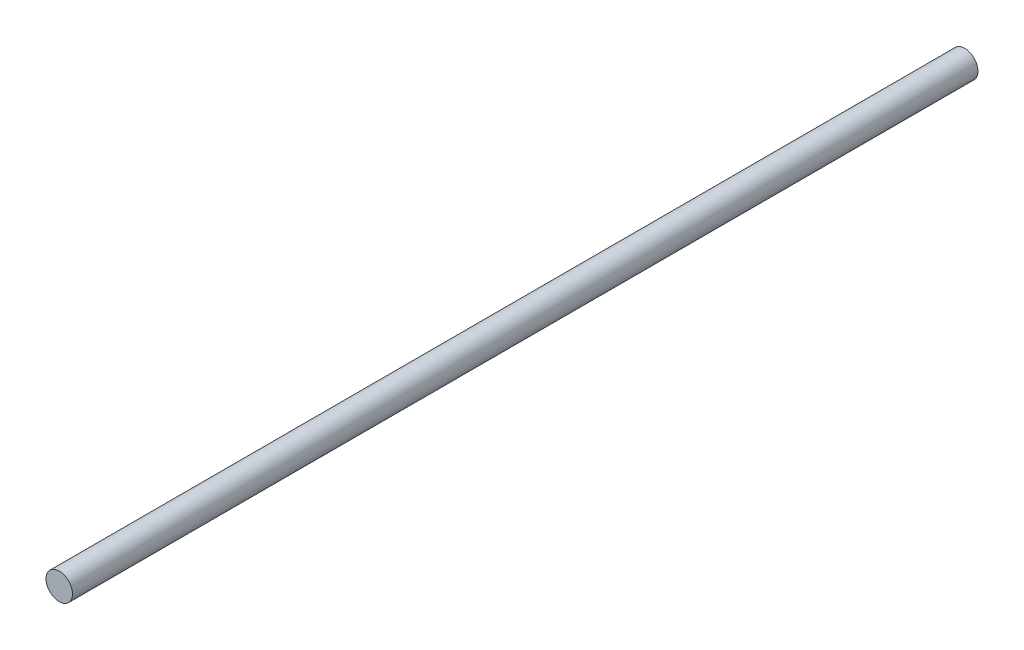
ISO-10303-21;
HEADER;
FILE_DESCRIPTION(('STEP AP214'),'2;1');
FILE_NAME('part.step','',(''),(''),'','','');
FILE_SCHEMA(('AUTOMOTIVE_DESIGN { 1 0 10303 214 1 1 1 1 }'));
ENDSEC;
DATA;
#1=APPLICATION_CONTEXT('core data for automotive mechanical design processes');
#2=APPLICATION_PROTOCOL_DEFINITION('international standard','automotive_design',2000,#1);
#3=PRODUCT_CONTEXT('',#1,'mechanical');
#4=PRODUCT('Part','Part','',(#3));
#5=PRODUCT_RELATED_PRODUCT_CATEGORY('part','',(#4));
#6=PRODUCT_DEFINITION_FORMATION('','',#4);
#7=PRODUCT_DEFINITION_CONTEXT('part definition',#1,'design');
#8=PRODUCT_DEFINITION('design','',#6,#7);
#9=PRODUCT_DEFINITION_SHAPE('','',#8);
#10=(LENGTH_UNIT() NAMED_UNIT(*) SI_UNIT(.MILLI.,.METRE.));
#11=(NAMED_UNIT(*) PLANE_ANGLE_UNIT() SI_UNIT($,.RADIAN.));
#12=(NAMED_UNIT(*) SI_UNIT($,.STERADIAN.) SOLID_ANGLE_UNIT());
#13=UNCERTAINTY_MEASURE_WITH_UNIT(LENGTH_MEASURE(1.E-05),#10,'distance_accuracy_value','');
#14=(GEOMETRIC_REPRESENTATION_CONTEXT(3) GLOBAL_UNCERTAINTY_ASSIGNED_CONTEXT((#13)) GLOBAL_UNIT_ASSIGNED_CONTEXT((#10,
#11,#12)) REPRESENTATION_CONTEXT('',''));
#15=CARTESIAN_POINT('',(0.,0.,0.));
#16=DIRECTION('',(0.,0.,1.));
#17=DIRECTION('',(1.,0.,0.));
#18=AXIS2_PLACEMENT_3D('',#15,#16,#17);
#19=CARTESIAN_POINT('',(0.,0.,-2050.));
#20=DIRECTION('',(0.,0.,1.));
#21=DIRECTION('',(1.,0.,0.));
#22=AXIS2_PLACEMENT_3D('',#19,#20,#21);
#23=CYLINDRICAL_SURFACE('',#22,30.);
#24=CARTESIAN_POINT('',(0.,0.,-2050.));
#25=DIRECTION('',(0.,0.,1.));
#26=DIRECTION('',(1.,0.,0.));
#27=AXIS2_PLACEMENT_3D('',#24,#25,#26);
#28=CIRCLE('',#27,30.);
#29=CARTESIAN_POINT('',(30.,0.,-2050.));
#30=VERTEX_POINT('',#29);
#31=EDGE_CURVE('E10',#30,#30,#28,.T.);
#32=ORIENTED_EDGE('',*,*,#31,.T.);
#33=EDGE_LOOP('',(#32));
#34=FACE_BOUND('',#33,.T.);
#35=CARTESIAN_POINT('',(0.,0.,0.));
#36=DIRECTION('',(0.,0.,1.));
#37=DIRECTION('',(1.,0.,0.));
#38=AXIS2_PLACEMENT_3D('',#35,#36,#37);
#39=CIRCLE('',#38,30.);
#40=CARTESIAN_POINT('',(30.,0.,0.));
#41=VERTEX_POINT('',#40);
#42=EDGE_CURVE('E40',#41,#41,#39,.T.);
#43=ORIENTED_EDGE('',*,*,#42,.F.);
#44=EDGE_LOOP('',(#43));
#45=FACE_BOUND('',#44,.T.);
#46=ADVANCED_FACE('F37',(#34,#45),#23,.T.);
#47=CARTESIAN_POINT('',(0.,0.,-2050.));
#48=DIRECTION('',(0.,0.,1.));
#49=DIRECTION('',(1.,0.,0.));
#50=AXIS2_PLACEMENT_3D('',#47,#48,#49);
#51=PLANE('',#50);
#52=ORIENTED_EDGE('',*,*,#31,.F.);
#53=EDGE_LOOP('',(#52));
#54=FACE_BOUND('',#53,.T.);
#55=ADVANCED_FACE('F54',(#54),#51,.F.);
#56=CARTESIAN_POINT('',(0.,0.,0.));
#57=DIRECTION('',(0.,0.,1.));
#58=DIRECTION('',(1.,0.,0.));
#59=AXIS2_PLACEMENT_3D('',#56,#57,#58);
#60=PLANE('',#59);
#61=ORIENTED_EDGE('',*,*,#42,.T.);
#62=EDGE_LOOP('',(#61));
#63=FACE_BOUND('',#62,.T.);
#64=ADVANCED_FACE('F51',(#63),#60,.T.);
#65=CLOSED_SHELL('',(#46,#55,#64));
#66=MANIFOLD_SOLID_BREP('B2',#65);
#67=ADVANCED_BREP_SHAPE_REPRESENTATION('',(#18,#66),#14);
#68=SHAPE_DEFINITION_REPRESENTATION(#9,#67);
ENDSEC;
END-ISO-10303-21;
